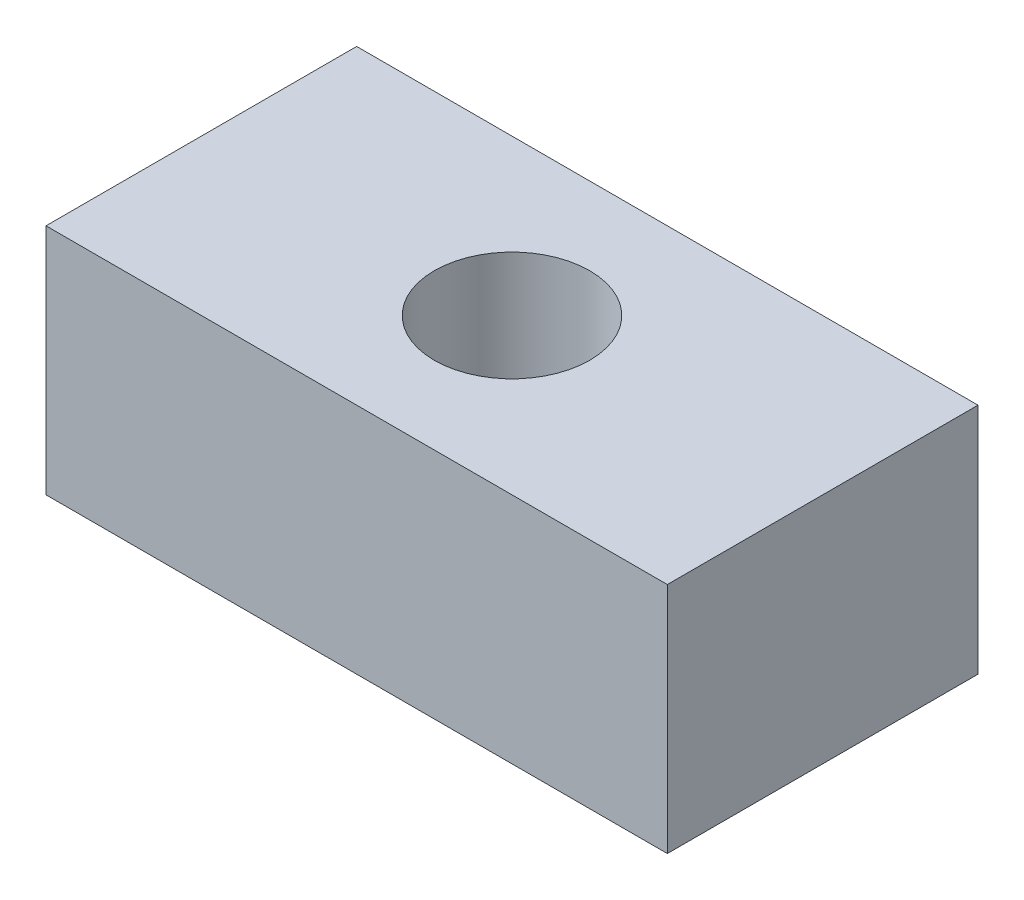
from build123d import *

# Parameters (mm, degrees)
SKETCH1_W      = 50.8
SKETCH1_H      = 25.4
EXTRUDE1_DEPTH = 19.05
SKETCH2_R      = 6.35
EXTRUDE2_DEPTH = 12.7


with BuildPart() as part:
    # Sketch1 → Extrude1 (new body)
    with BuildSketch(Plane(origin=(0, 0, 0), x_dir=(1, 0, 0), z_dir=(0, 1, 0))):
        Rectangle(SKETCH1_W, SKETCH1_H)
    extrude(amount=EXTRUDE1_DEPTH)

    # Sketch2 → Extrude2 (cut)
    with BuildSketch(Plane(origin=(0, 19.05, 0), x_dir=(1, 0, 0), z_dir=(0, 1, 0))):
        with Locations(Location((0, 0, 0), (0, 0, 270))):
            Circle(SKETCH2_R)
    extrude(amount=-EXTRUDE2_DEPTH, mode=Mode.SUBTRACT)


solid = part.part
